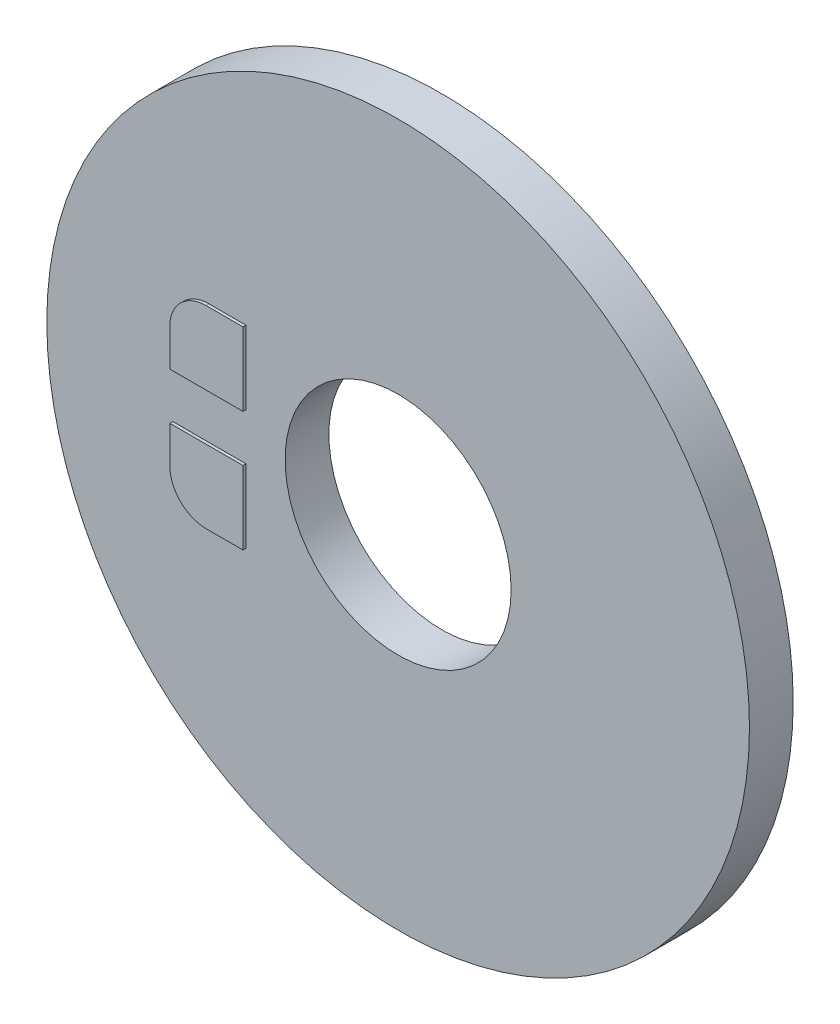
ISO-10303-21;
HEADER;
FILE_DESCRIPTION(('STEP AP214'),'2;1');
FILE_NAME('part.step','',(''),(''),'','','');
FILE_SCHEMA(('AUTOMOTIVE_DESIGN { 1 0 10303 214 1 1 1 1 }'));
ENDSEC;
DATA;
#1=APPLICATION_CONTEXT('core data for automotive mechanical design processes');
#2=APPLICATION_PROTOCOL_DEFINITION('international standard','automotive_design',2000,#1);
#3=PRODUCT_CONTEXT('',#1,'mechanical');
#4=PRODUCT('Part','Part','',(#3));
#5=PRODUCT_RELATED_PRODUCT_CATEGORY('part','',(#4));
#6=PRODUCT_DEFINITION_FORMATION('','',#4);
#7=PRODUCT_DEFINITION_CONTEXT('part definition',#1,'design');
#8=PRODUCT_DEFINITION('design','',#6,#7);
#9=PRODUCT_DEFINITION_SHAPE('','',#8);
#10=(LENGTH_UNIT() NAMED_UNIT(*) SI_UNIT(.MILLI.,.METRE.));
#11=(NAMED_UNIT(*) PLANE_ANGLE_UNIT() SI_UNIT($,.RADIAN.));
#12=(NAMED_UNIT(*) SI_UNIT($,.STERADIAN.) SOLID_ANGLE_UNIT());
#13=UNCERTAINTY_MEASURE_WITH_UNIT(LENGTH_MEASURE(1.E-05),#10,'distance_accuracy_value','');
#14=(GEOMETRIC_REPRESENTATION_CONTEXT(3) GLOBAL_UNCERTAINTY_ASSIGNED_CONTEXT((#13)) GLOBAL_UNIT_ASSIGNED_CONTEXT((#10,
#11,#12)) REPRESENTATION_CONTEXT('',''));
#15=CARTESIAN_POINT('',(0.,0.,0.));
#16=DIRECTION('',(0.,0.,1.));
#17=DIRECTION('',(1.,0.,0.));
#18=AXIS2_PLACEMENT_3D('',#15,#16,#17);
#19=CARTESIAN_POINT('',(0.,0.,1.89738));
#20=DIRECTION('',(0.,0.,1.));
#21=DIRECTION('',(1.,0.,0.));
#22=AXIS2_PLACEMENT_3D('',#19,#20,#21);
#23=PLANE('',#22);
#24=DIRECTION('',(0.,-1.,0.));
#25=VECTOR('',#24,1.);
#26=CARTESIAN_POINT('',(-6.604,-4.191,1.89738));
#27=LINE('',#26,#25);
#28=CARTESIAN_POINT('',(-6.604,-1.016,1.89738));
#29=VERTEX_POINT('',#28);
#30=CARTESIAN_POINT('',(-6.604,-4.191,1.89738));
#31=VERTEX_POINT('',#30);
#32=EDGE_CURVE('E117',#29,#31,#27,.T.);
#33=ORIENTED_EDGE('',*,*,#32,.T.);
#34=DIRECTION('',(-1.,0.,0.));
#35=VECTOR('',#34,1.);
#36=CARTESIAN_POINT('',(-8.2042,-4.191,1.89738));
#37=LINE('',#36,#35);
#38=CARTESIAN_POINT('',(-8.2042,-4.191,1.89738));
#39=VERTEX_POINT('',#38);
#40=EDGE_CURVE('E132',#31,#39,#37,.T.);
#41=ORIENTED_EDGE('',*,*,#40,.T.);
#42=CARTESIAN_POINT('',(-8.2042,-2.6162,1.89738));
#43=DIRECTION('',(0.,0.,-1.));
#44=DIRECTION('',(-1.,0.,0.));
#45=AXIS2_PLACEMENT_3D('',#42,#43,#44);
#46=CIRCLE('',#45,1.5748);
#47=CARTESIAN_POINT('',(-9.779,-2.6162,1.89738));
#48=VERTEX_POINT('',#47);
#49=EDGE_CURVE('E149',#39,#48,#46,.T.);
#50=ORIENTED_EDGE('',*,*,#49,.T.);
#51=DIRECTION('',(0.,1.,0.));
#52=VECTOR('',#51,1.);
#53=CARTESIAN_POINT('',(-9.779,-2.6162,1.89738));
#54=LINE('',#53,#52);
#55=CARTESIAN_POINT('',(-9.779,-1.016,1.89738));
#56=VERTEX_POINT('',#55);
#57=EDGE_CURVE('E55',#48,#56,#54,.T.);
#58=ORIENTED_EDGE('',*,*,#57,.T.);
#59=DIRECTION('',(1.,0.,0.));
#60=VECTOR('',#59,1.);
#61=CARTESIAN_POINT('',(-9.779,-1.016,1.89738));
#62=LINE('',#61,#60);
#63=EDGE_CURVE('E50',#56,#29,#62,.T.);
#64=ORIENTED_EDGE('',*,*,#63,.T.);
#65=EDGE_LOOP('',(#33,#41,#50,#58,#64));
#66=FACE_BOUND('',#65,.T.);
#67=DIRECTION('',(-1.,0.,0.));
#68=VECTOR('',#67,1.);
#69=CARTESIAN_POINT('',(-8.2042,4.191,1.89738));
#70=LINE('',#69,#68);
#71=CARTESIAN_POINT('',(-6.604,4.191,1.89738));
#72=VERTEX_POINT('',#71);
#73=CARTESIAN_POINT('',(-8.2042,4.191,1.89738));
#74=VERTEX_POINT('',#73);
#75=EDGE_CURVE('E175',#72,#74,#70,.T.);
#76=ORIENTED_EDGE('',*,*,#75,.F.);
#77=DIRECTION('',(0.,1.,0.));
#78=VECTOR('',#77,1.);
#79=CARTESIAN_POINT('',(-6.604,4.191,1.89738));
#80=LINE('',#79,#78);
#81=CARTESIAN_POINT('',(-6.604,1.016,1.89738));
#82=VERTEX_POINT('',#81);
#83=EDGE_CURVE('E120',#82,#72,#80,.T.);
#84=ORIENTED_EDGE('',*,*,#83,.F.);
#85=DIRECTION('',(1.,0.,0.));
#86=VECTOR('',#85,1.);
#87=CARTESIAN_POINT('',(-9.779,1.016,1.89738));
#88=LINE('',#87,#86);
#89=CARTESIAN_POINT('',(-9.779,1.016,1.89738));
#90=VERTEX_POINT('',#89);
#91=EDGE_CURVE('E164',#90,#82,#88,.T.);
#92=ORIENTED_EDGE('',*,*,#91,.F.);
#93=DIRECTION('',(0.,-1.,0.));
#94=VECTOR('',#93,1.);
#95=CARTESIAN_POINT('',(-9.779,2.6162,1.89738));
#96=LINE('',#95,#94);
#97=CARTESIAN_POINT('',(-9.779,2.6162,1.89738));
#98=VERTEX_POINT('',#97);
#99=EDGE_CURVE('E179',#98,#90,#96,.T.);
#100=ORIENTED_EDGE('',*,*,#99,.F.);
#101=CARTESIAN_POINT('',(-8.2042,2.6162,1.89738));
#102=DIRECTION('',(0.,0.,1.));
#103=DIRECTION('',(-1.,0.,0.));
#104=AXIS2_PLACEMENT_3D('',#101,#102,#103);
#105=CIRCLE('',#104,1.5748);
#106=EDGE_CURVE('E177',#74,#98,#105,.T.);
#107=ORIENTED_EDGE('',*,*,#106,.F.);
#108=EDGE_LOOP('',(#76,#84,#92,#100,#107));
#109=FACE_BOUND('',#108,.T.);
#110=CARTESIAN_POINT('',(0.,0.,1.89738));
#111=DIRECTION('',(0.,0.,1.));
#112=DIRECTION('',(1.,0.,0.));
#113=AXIS2_PLACEMENT_3D('',#110,#111,#112);
#114=CIRCLE('',#113,4.9022);
#115=CARTESIAN_POINT('',(4.9022,0.,1.89738));
#116=VERTEX_POINT('',#115);
#117=EDGE_CURVE('E146',#116,#116,#114,.T.);
#118=ORIENTED_EDGE('',*,*,#117,.F.);
#119=EDGE_LOOP('',(#118));
#120=FACE_BOUND('',#119,.T.);
#121=CARTESIAN_POINT('',(0.,0.,1.89738));
#122=DIRECTION('',(0.,0.,1.));
#123=DIRECTION('',(1.,0.,0.));
#124=AXIS2_PLACEMENT_3D('',#121,#122,#123);
#125=CIRCLE('',#124,15.24);
#126=CARTESIAN_POINT('',(-15.24,0.,1.89738));
#127=VERTEX_POINT('',#126);
#128=EDGE_CURVE('E12',#127,#127,#125,.T.);
#129=ORIENTED_EDGE('',*,*,#128,.T.);
#130=EDGE_LOOP('',(#129));
#131=FACE_BOUND('',#130,.T.);
#132=ADVANCED_FACE('F33',(#66,#109,#120,#131),#23,.T.);
#133=CARTESIAN_POINT('',(0.,0.,0.));
#134=DIRECTION('',(0.,0.,1.));
#135=DIRECTION('',(1.,0.,0.));
#136=AXIS2_PLACEMENT_3D('',#133,#134,#135);
#137=PLANE('',#136);
#138=CARTESIAN_POINT('',(0.,0.,0.));
#139=DIRECTION('',(0.,0.,1.));
#140=DIRECTION('',(1.,0.,0.));
#141=AXIS2_PLACEMENT_3D('',#138,#139,#140);
#142=CIRCLE('',#141,4.9022);
#143=CARTESIAN_POINT('',(4.9022,0.,0.));
#144=VERTEX_POINT('',#143);
#145=EDGE_CURVE('E37',#144,#144,#142,.T.);
#146=ORIENTED_EDGE('',*,*,#145,.T.);
#147=EDGE_LOOP('',(#146));
#148=FACE_BOUND('',#147,.T.);
#149=CARTESIAN_POINT('',(0.,0.,0.));
#150=DIRECTION('',(0.,0.,1.));
#151=DIRECTION('',(1.,0.,0.));
#152=AXIS2_PLACEMENT_3D('',#149,#150,#151);
#153=CIRCLE('',#152,15.24);
#154=CARTESIAN_POINT('',(-15.24,0.,0.));
#155=VERTEX_POINT('',#154);
#156=EDGE_CURVE('E42',#155,#155,#153,.T.);
#157=ORIENTED_EDGE('',*,*,#156,.F.);
#158=EDGE_LOOP('',(#157));
#159=FACE_BOUND('',#158,.T.);
#160=ADVANCED_FACE('F199',(#148,#159),#137,.F.);
#161=CARTESIAN_POINT('',(0.,0.,1.89738));
#162=DIRECTION('',(0.,0.,-1.));
#163=DIRECTION('',(-1.,0.,0.));
#164=AXIS2_PLACEMENT_3D('',#161,#162,#163);
#165=CYLINDRICAL_SURFACE('',#164,15.24);
#166=CARTESIAN_POINT('',(-15.24,0.,0.));
#167=CARTESIAN_POINT('',(-15.24,0.,0.0197643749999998));
#168=CARTESIAN_POINT('',(-15.24,0.,0.0395287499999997));
#169=CARTESIAN_POINT('',(-15.24,0.,0.0790574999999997));
#170=CARTESIAN_POINT('',(-15.24,0.,0.0988218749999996));
#171=CARTESIAN_POINT('',(-15.24,0.,0.138350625));
#172=CARTESIAN_POINT('',(-15.24,0.,0.158115));
#173=CARTESIAN_POINT('',(-15.24,0.,0.197643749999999));
#174=CARTESIAN_POINT('',(-15.24,0.,0.217408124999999));
#175=CARTESIAN_POINT('',(-15.24,0.,0.256936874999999));
#176=CARTESIAN_POINT('',(-15.24,0.,0.276701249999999));
#177=CARTESIAN_POINT('',(-15.24,0.,0.316229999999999));
#178=CARTESIAN_POINT('',(-15.24,0.,0.335994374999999));
#179=CARTESIAN_POINT('',(-15.24,0.,0.375523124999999));
#180=CARTESIAN_POINT('',(-15.24,0.,0.395287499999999));
#181=CARTESIAN_POINT('',(-15.24,0.,0.434816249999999));
#182=CARTESIAN_POINT('',(-15.24,0.,0.454580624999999));
#183=CARTESIAN_POINT('',(-15.24,0.,0.494109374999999));
#184=CARTESIAN_POINT('',(-15.24,0.,0.513873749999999));
#185=CARTESIAN_POINT('',(-15.24,0.,0.553402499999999));
#186=CARTESIAN_POINT('',(-15.24,0.,0.573166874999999));
#187=CARTESIAN_POINT('',(-15.24,0.,0.612695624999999));
#188=CARTESIAN_POINT('',(-15.24,0.,0.632459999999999));
#189=CARTESIAN_POINT('',(-15.24,0.,0.671988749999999));
#190=CARTESIAN_POINT('',(-15.24,0.,0.691753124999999));
#191=CARTESIAN_POINT('',(-15.24,0.,0.731281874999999));
#192=CARTESIAN_POINT('',(-15.24,0.,0.751046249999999));
#193=CARTESIAN_POINT('',(-15.24,0.,0.790574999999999));
#194=CARTESIAN_POINT('',(-15.24,0.,0.810339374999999));
#195=CARTESIAN_POINT('',(-15.24,0.,0.849868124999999));
#196=CARTESIAN_POINT('',(-15.24,0.,0.869632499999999));
#197=CARTESIAN_POINT('',(-15.24,0.,0.909161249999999));
#198=CARTESIAN_POINT('',(-15.24,0.,0.928925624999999));
#199=CARTESIAN_POINT('',(-15.24,0.,0.968454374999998));
#200=CARTESIAN_POINT('',(-15.24,0.,0.988218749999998));
#201=CARTESIAN_POINT('',(-15.24,0.,1.0277475));
#202=CARTESIAN_POINT('',(-15.24,0.,1.047511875));
#203=CARTESIAN_POINT('',(-15.24,0.,1.087040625));
#204=CARTESIAN_POINT('',(-15.24,0.,1.106805));
#205=CARTESIAN_POINT('',(-15.24,0.,1.14633375));
#206=CARTESIAN_POINT('',(-15.24,0.,1.166098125));
#207=CARTESIAN_POINT('',(-15.24,0.,1.205626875));
#208=CARTESIAN_POINT('',(-15.24,0.,1.22539125));
#209=CARTESIAN_POINT('',(-15.24,0.,1.26492));
#210=CARTESIAN_POINT('',(-15.24,0.,1.284684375));
#211=CARTESIAN_POINT('',(-15.24,0.,1.324213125));
#212=CARTESIAN_POINT('',(-15.24,0.,1.3439775));
#213=CARTESIAN_POINT('',(-15.24,0.,1.38350625));
#214=CARTESIAN_POINT('',(-15.24,0.,1.403270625));
#215=CARTESIAN_POINT('',(-15.24,0.,1.442799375));
#216=CARTESIAN_POINT('',(-15.24,0.,1.46256375));
#217=CARTESIAN_POINT('',(-15.24,0.,1.5020925));
#218=CARTESIAN_POINT('',(-15.24,0.,1.521856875));
#219=CARTESIAN_POINT('',(-15.24,0.,1.561385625));
#220=CARTESIAN_POINT('',(-15.24,0.,1.58115));
#221=CARTESIAN_POINT('',(-15.24,0.,1.62067875));
#222=CARTESIAN_POINT('',(-15.24,0.,1.640443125));
#223=CARTESIAN_POINT('',(-15.24,0.,1.679971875));
#224=CARTESIAN_POINT('',(-15.24,0.,1.69973625));
#225=CARTESIAN_POINT('',(-15.24,0.,1.739265));
#226=CARTESIAN_POINT('',(-15.24,0.,1.759029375));
#227=CARTESIAN_POINT('',(-15.24,0.,1.798558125));
#228=CARTESIAN_POINT('',(-15.24,0.,1.8183225));
#229=CARTESIAN_POINT('',(-15.24,0.,1.85785125));
#230=CARTESIAN_POINT('',(-15.24,0.,1.877615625));
#231=CARTESIAN_POINT('',(-15.24,0.,1.89738));
#232=B_SPLINE_CURVE_WITH_KNOTS('',3,(#166,#167,#168,#169,#170,#171,#172,#173,#174,#175,#176,
#177,#178,#179,#180,#181,#182,#183,#184,#185,#186,#187,#188,#189,#190,#191,#192,#193,#194,#195,
#196,#197,#198,#199,#200,#201,#202,#203,#204,#205,#206,#207,#208,#209,#210,#211,#212,#213,#214,
#215,#216,#217,#218,#219,#220,#221,#222,#223,#224,#225,#226,#227,#228,#229,#230,#231),
.UNSPECIFIED.,.F.,.F.,(4,2,2,2,2,2,2,2,2,2,2,2,2,2,2,2,2,2,2,2,2,2,2,2,2,2,2,2,2,2,2,2,4),(0.,
0.0592931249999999,0.11858625,0.177879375,0.2371725,0.296465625,0.355758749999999,0.415051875,
0.474344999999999,0.533638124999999,0.592931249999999,0.652224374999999,0.711517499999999,
0.770810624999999,0.830103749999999,0.889396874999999,0.948689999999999,1.007983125,1.06727625,
1.126569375,1.1858625,1.245155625,1.30444875,1.363741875,1.423035,1.482328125,1.54162125,
1.600914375,1.6602075,1.719500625,1.77879375,1.838086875,1.89738),.UNSPECIFIED.);
#233=EDGE_CURVE('BSEAM35',#155,#127,#232,.T.);
#234=ORIENTED_EDGE('',*,*,#156,.T.);
#235=ORIENTED_EDGE('',*,*,#128,.F.);
#236=ORIENTED_EDGE('',*,*,#233,.T.);
#237=ORIENTED_EDGE('',*,*,#233,.F.);
#238=EDGE_LOOP('',(#234,#236,#235,#237));
#239=FACE_BOUND('',#238,.T.);
#240=ADVANCED_FACE('F35',(#239),#165,.T.);
#241=CARTESIAN_POINT('',(-6.604,4.191,2.02438));
#242=DIRECTION('',(-1.,0.,0.));
#243=DIRECTION('',(0.,-1.,0.));
#244=AXIS2_PLACEMENT_3D('',#241,#242,#243);
#245=PLANE('',#244);
#246=ORIENTED_EDGE('',*,*,#83,.T.);
#247=DIRECTION('',(0.,0.,-1.));
#248=VECTOR('',#247,1.);
#249=CARTESIAN_POINT('',(-6.604,4.191,2.02438));
#250=LINE('',#249,#248);
#251=CARTESIAN_POINT('',(-6.604,4.191,2.02438));
#252=VERTEX_POINT('',#251);
#253=EDGE_CURVE('E193',#252,#72,#250,.T.);
#254=ORIENTED_EDGE('',*,*,#253,.F.);
#255=DIRECTION('',(0.,1.,0.));
#256=VECTOR('',#255,1.);
#257=CARTESIAN_POINT('',(-6.604,4.191,2.02438));
#258=LINE('',#257,#256);
#259=CARTESIAN_POINT('',(-6.604,1.016,2.02438));
#260=VERTEX_POINT('',#259);
#261=EDGE_CURVE('E160',#260,#252,#258,.T.);
#262=ORIENTED_EDGE('',*,*,#261,.F.);
#263=DIRECTION('',(0.,0.,-1.));
#264=VECTOR('',#263,1.);
#265=CARTESIAN_POINT('',(-6.604,1.016,2.02438));
#266=LINE('',#265,#264);
#267=EDGE_CURVE('E172',#260,#82,#266,.T.);
#268=ORIENTED_EDGE('',*,*,#267,.T.);
#269=EDGE_LOOP('',(#246,#254,#262,#268));
#270=FACE_BOUND('',#269,.T.);
#271=ADVANCED_FACE('F206',(#270),#245,.F.);
#272=CARTESIAN_POINT('',(-8.2042,4.191,2.02438));
#273=DIRECTION('',(0.,-1.,0.));
#274=DIRECTION('',(0.,0.,-1.));
#275=AXIS2_PLACEMENT_3D('',#272,#273,#274);
#276=PLANE('',#275);
#277=ORIENTED_EDGE('',*,*,#75,.T.);
#278=DIRECTION('',(0.,0.,-1.));
#279=VECTOR('',#278,1.);
#280=CARTESIAN_POINT('',(-8.2042,4.191,2.02438));
#281=LINE('',#280,#279);
#282=CARTESIAN_POINT('',(-8.2042,4.191,2.02438));
#283=VERTEX_POINT('',#282);
#284=EDGE_CURVE('E190',#283,#74,#281,.T.);
#285=ORIENTED_EDGE('',*,*,#284,.F.);
#286=DIRECTION('',(-1.,0.,0.));
#287=VECTOR('',#286,1.);
#288=CARTESIAN_POINT('',(-8.2042,4.191,2.02438));
#289=LINE('',#288,#287);
#290=EDGE_CURVE('E163',#252,#283,#289,.T.);
#291=ORIENTED_EDGE('',*,*,#290,.F.);
#292=ORIENTED_EDGE('',*,*,#253,.T.);
#293=EDGE_LOOP('',(#277,#285,#291,#292));
#294=FACE_BOUND('',#293,.T.);
#295=ADVANCED_FACE('F212',(#294),#276,.F.);
#296=CARTESIAN_POINT('',(-8.2042,2.6162,2.02438));
#297=DIRECTION('',(0.,0.,-1.));
#298=DIRECTION('',(-1.,0.,0.));
#299=AXIS2_PLACEMENT_3D('',#296,#297,#298);
#300=CYLINDRICAL_SURFACE('',#299,1.5748);
#301=ORIENTED_EDGE('',*,*,#106,.T.);
#302=DIRECTION('',(0.,0.,-1.));
#303=VECTOR('',#302,1.);
#304=CARTESIAN_POINT('',(-9.779,2.6162,2.02438));
#305=LINE('',#304,#303);
#306=CARTESIAN_POINT('',(-9.779,2.6162,2.02438));
#307=VERTEX_POINT('',#306);
#308=EDGE_CURVE('E187',#307,#98,#305,.T.);
#309=ORIENTED_EDGE('',*,*,#308,.F.);
#310=CARTESIAN_POINT('',(-8.2042,2.6162,2.02438));
#311=DIRECTION('',(0.,0.,1.));
#312=DIRECTION('',(-1.,0.,0.));
#313=AXIS2_PLACEMENT_3D('',#310,#311,#312);
#314=CIRCLE('',#313,1.5748);
#315=EDGE_CURVE('E166',#283,#307,#314,.T.);
#316=ORIENTED_EDGE('',*,*,#315,.F.);
#317=ORIENTED_EDGE('',*,*,#284,.T.);
#318=EDGE_LOOP('',(#301,#309,#316,#317));
#319=FACE_BOUND('',#318,.T.);
#320=ADVANCED_FACE('F216',(#319),#300,.T.);
#321=CARTESIAN_POINT('',(-9.779,2.6162,2.02438));
#322=DIRECTION('',(1.,0.,0.));
#323=DIRECTION('',(0.,1.,0.));
#324=AXIS2_PLACEMENT_3D('',#321,#322,#323);
#325=PLANE('',#324);
#326=ORIENTED_EDGE('',*,*,#99,.T.);
#327=DIRECTION('',(0.,0.,-1.));
#328=VECTOR('',#327,1.);
#329=CARTESIAN_POINT('',(-9.779,1.016,2.02438));
#330=LINE('',#329,#328);
#331=CARTESIAN_POINT('',(-9.779,1.016,2.02438));
#332=VERTEX_POINT('',#331);
#333=EDGE_CURVE('E185',#332,#90,#330,.T.);
#334=ORIENTED_EDGE('',*,*,#333,.F.);
#335=DIRECTION('',(0.,-1.,0.));
#336=VECTOR('',#335,1.);
#337=CARTESIAN_POINT('',(-9.779,2.6162,2.02438));
#338=LINE('',#337,#336);
#339=EDGE_CURVE('E168',#307,#332,#338,.T.);
#340=ORIENTED_EDGE('',*,*,#339,.F.);
#341=ORIENTED_EDGE('',*,*,#308,.T.);
#342=EDGE_LOOP('',(#326,#334,#340,#341));
#343=FACE_BOUND('',#342,.T.);
#344=ADVANCED_FACE('F220',(#343),#325,.F.);
#345=CARTESIAN_POINT('',(-9.779,1.016,2.02438));
#346=DIRECTION('',(0.,1.,0.));
#347=DIRECTION('',(0.,0.,1.));
#348=AXIS2_PLACEMENT_3D('',#345,#346,#347);
#349=PLANE('',#348);
#350=ORIENTED_EDGE('',*,*,#91,.T.);
#351=ORIENTED_EDGE('',*,*,#267,.F.);
#352=DIRECTION('',(1.,0.,0.));
#353=VECTOR('',#352,1.);
#354=CARTESIAN_POINT('',(-9.779,1.016,2.02438));
#355=LINE('',#354,#353);
#356=EDGE_CURVE('E170',#332,#260,#355,.T.);
#357=ORIENTED_EDGE('',*,*,#356,.F.);
#358=ORIENTED_EDGE('',*,*,#333,.T.);
#359=EDGE_LOOP('',(#350,#351,#357,#358));
#360=FACE_BOUND('',#359,.T.);
#361=ADVANCED_FACE('F224',(#360),#349,.F.);
#362=CARTESIAN_POINT('',(-8.2042,2.6162,2.02438));
#363=DIRECTION('',(0.,0.,-1.));
#364=DIRECTION('',(-1.,0.,0.));
#365=AXIS2_PLACEMENT_3D('',#362,#363,#364);
#366=PLANE('',#365);
#367=ORIENTED_EDGE('',*,*,#261,.T.);
#368=ORIENTED_EDGE('',*,*,#290,.T.);
#369=ORIENTED_EDGE('',*,*,#315,.T.);
#370=ORIENTED_EDGE('',*,*,#339,.T.);
#371=ORIENTED_EDGE('',*,*,#356,.T.);
#372=EDGE_LOOP('',(#367,#368,#369,#370,#371));
#373=FACE_BOUND('',#372,.T.);
#374=ADVANCED_FACE('F228',(#373),#366,.F.);
#375=CARTESIAN_POINT('',(-6.604,-4.191,2.02438));
#376=DIRECTION('',(1.,0.,0.));
#377=DIRECTION('',(0.,1.,0.));
#378=AXIS2_PLACEMENT_3D('',#375,#376,#377);
#379=PLANE('',#378);
#380=ORIENTED_EDGE('',*,*,#32,.F.);
#381=DIRECTION('',(0.,0.,-1.));
#382=VECTOR('',#381,1.);
#383=CARTESIAN_POINT('',(-6.604,-1.016,2.02438));
#384=LINE('',#383,#382);
#385=CARTESIAN_POINT('',(-6.604,-1.016,2.02438));
#386=VERTEX_POINT('',#385);
#387=EDGE_CURVE('E111',#386,#29,#384,.T.);
#388=ORIENTED_EDGE('',*,*,#387,.F.);
#389=DIRECTION('',(0.,-1.,0.));
#390=VECTOR('',#389,1.);
#391=CARTESIAN_POINT('',(-6.604,-4.191,2.02438));
#392=LINE('',#391,#390);
#393=CARTESIAN_POINT('',(-6.604,-4.191,2.02438));
#394=VERTEX_POINT('',#393);
#395=EDGE_CURVE('E115',#386,#394,#392,.T.);
#396=ORIENTED_EDGE('',*,*,#395,.T.);
#397=DIRECTION('',(0.,0.,-1.));
#398=VECTOR('',#397,1.);
#399=CARTESIAN_POINT('',(-6.604,-4.191,2.02438));
#400=LINE('',#399,#398);
#401=EDGE_CURVE('E144',#394,#31,#400,.T.);
#402=ORIENTED_EDGE('',*,*,#401,.T.);
#403=EDGE_LOOP('',(#380,#388,#396,#402));
#404=FACE_BOUND('',#403,.T.);
#405=ADVANCED_FACE('F113',(#404),#379,.T.);
#406=CARTESIAN_POINT('',(-9.779,-1.016,2.02438));
#407=DIRECTION('',(0.,1.,0.));
#408=DIRECTION('',(0.,0.,1.));
#409=AXIS2_PLACEMENT_3D('',#406,#407,#408);
#410=PLANE('',#409);
#411=ORIENTED_EDGE('',*,*,#63,.F.);
#412=DIRECTION('',(0.,0.,-1.));
#413=VECTOR('',#412,1.);
#414=CARTESIAN_POINT('',(-9.779,-1.016,2.02438));
#415=LINE('',#414,#413);
#416=CARTESIAN_POINT('',(-9.779,-1.016,2.02438));
#417=VERTEX_POINT('',#416);
#418=EDGE_CURVE('E121',#417,#56,#415,.T.);
#419=ORIENTED_EDGE('',*,*,#418,.F.);
#420=DIRECTION('',(1.,0.,0.));
#421=VECTOR('',#420,1.);
#422=CARTESIAN_POINT('',(-9.779,-1.016,2.02438));
#423=LINE('',#422,#421);
#424=EDGE_CURVE('E127',#417,#386,#423,.T.);
#425=ORIENTED_EDGE('',*,*,#424,.T.);
#426=ORIENTED_EDGE('',*,*,#387,.T.);
#427=EDGE_LOOP('',(#411,#419,#425,#426));
#428=FACE_BOUND('',#427,.T.);
#429=ADVANCED_FACE('F134',(#428),#410,.T.);
#430=CARTESIAN_POINT('',(-9.779,-2.6162,2.02438));
#431=DIRECTION('',(-1.,0.,0.));
#432=DIRECTION('',(0.,-1.,0.));
#433=AXIS2_PLACEMENT_3D('',#430,#431,#432);
#434=PLANE('',#433);
#435=ORIENTED_EDGE('',*,*,#57,.F.);
#436=DIRECTION('',(0.,0.,-1.));
#437=VECTOR('',#436,1.);
#438=CARTESIAN_POINT('',(-9.779,-2.6162,2.02438));
#439=LINE('',#438,#437);
#440=CARTESIAN_POINT('',(-9.779,-2.6162,2.02438));
#441=VERTEX_POINT('',#440);
#442=EDGE_CURVE('E156',#441,#48,#439,.T.);
#443=ORIENTED_EDGE('',*,*,#442,.F.);
#444=DIRECTION('',(0.,1.,0.));
#445=VECTOR('',#444,1.);
#446=CARTESIAN_POINT('',(-9.779,-2.6162,2.02438));
#447=LINE('',#446,#445);
#448=EDGE_CURVE('E135',#441,#417,#447,.T.);
#449=ORIENTED_EDGE('',*,*,#448,.T.);
#450=ORIENTED_EDGE('',*,*,#418,.T.);
#451=EDGE_LOOP('',(#435,#443,#449,#450));
#452=FACE_BOUND('',#451,.T.);
#453=ADVANCED_FACE('F237',(#452),#434,.T.);
#454=CARTESIAN_POINT('',(-8.2042,-2.6162,2.02438));
#455=DIRECTION('',(0.,0.,-1.));
#456=DIRECTION('',(-1.,0.,0.));
#457=AXIS2_PLACEMENT_3D('',#454,#455,#456);
#458=CYLINDRICAL_SURFACE('',#457,1.5748);
#459=ORIENTED_EDGE('',*,*,#49,.F.);
#460=DIRECTION('',(0.,0.,-1.));
#461=VECTOR('',#460,1.);
#462=CARTESIAN_POINT('',(-8.2042,-4.191,2.02438));
#463=LINE('',#462,#461);
#464=CARTESIAN_POINT('',(-8.2042,-4.191,2.02438));
#465=VERTEX_POINT('',#464);
#466=EDGE_CURVE('E153',#465,#39,#463,.T.);
#467=ORIENTED_EDGE('',*,*,#466,.F.);
#468=CARTESIAN_POINT('',(-8.2042,-2.6162,2.02438));
#469=DIRECTION('',(0.,0.,-1.));
#470=DIRECTION('',(-1.,0.,0.));
#471=AXIS2_PLACEMENT_3D('',#468,#469,#470);
#472=CIRCLE('',#471,1.5748);
#473=EDGE_CURVE('E137',#465,#441,#472,.T.);
#474=ORIENTED_EDGE('',*,*,#473,.T.);
#475=ORIENTED_EDGE('',*,*,#442,.T.);
#476=EDGE_LOOP('',(#459,#467,#474,#475));
#477=FACE_BOUND('',#476,.T.);
#478=ADVANCED_FACE('F240',(#477),#458,.T.);
#479=CARTESIAN_POINT('',(-8.2042,-4.191,2.02438));
#480=DIRECTION('',(0.,-1.,0.));
#481=DIRECTION('',(0.,0.,-1.));
#482=AXIS2_PLACEMENT_3D('',#479,#480,#481);
#483=PLANE('',#482);
#484=ORIENTED_EDGE('',*,*,#40,.F.);
#485=ORIENTED_EDGE('',*,*,#401,.F.);
#486=DIRECTION('',(-1.,0.,0.));
#487=VECTOR('',#486,1.);
#488=CARTESIAN_POINT('',(-8.2042,-4.191,2.02438));
#489=LINE('',#488,#487);
#490=EDGE_CURVE('E131',#394,#465,#489,.T.);
#491=ORIENTED_EDGE('',*,*,#490,.T.);
#492=ORIENTED_EDGE('',*,*,#466,.T.);
#493=EDGE_LOOP('',(#484,#485,#491,#492));
#494=FACE_BOUND('',#493,.T.);
#495=ADVANCED_FACE('F244',(#494),#483,.T.);
#496=CARTESIAN_POINT('',(-8.2042,-2.6162,2.02438));
#497=DIRECTION('',(0.,0.,-1.));
#498=DIRECTION('',(-1.,0.,0.));
#499=AXIS2_PLACEMENT_3D('',#496,#497,#498);
#500=PLANE('',#499);
#501=ORIENTED_EDGE('',*,*,#395,.F.);
#502=ORIENTED_EDGE('',*,*,#424,.F.);
#503=ORIENTED_EDGE('',*,*,#448,.F.);
#504=ORIENTED_EDGE('',*,*,#473,.F.);
#505=ORIENTED_EDGE('',*,*,#490,.F.);
#506=EDGE_LOOP('',(#501,#502,#503,#504,#505));
#507=FACE_BOUND('',#506,.T.);
#508=ADVANCED_FACE('F125',(#507),#500,.F.);
#509=CARTESIAN_POINT('',(0.,0.,-0.642620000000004));
#510=DIRECTION('',(0.,0.,1.));
#511=DIRECTION('',(1.,0.,0.));
#512=AXIS2_PLACEMENT_3D('',#509,#510,#511);
#513=CYLINDRICAL_SURFACE('',#512,4.9022);
#514=ORIENTED_EDGE('',*,*,#117,.T.);
#515=EDGE_LOOP('',(#514));
#516=FACE_BOUND('',#515,.T.);
#517=ORIENTED_EDGE('',*,*,#145,.F.);
#518=EDGE_LOOP('',(#517));
#519=FACE_BOUND('',#518,.T.);
#520=ADVANCED_FACE('F251',(#516,#519),#513,.F.);
#521=CLOSED_SHELL('',(#132,#160,#240,#271,#295,#320,#344,#361,#374,#405,#429,#453,#478,#495,
#508,#520));
#522=MANIFOLD_SOLID_BREP('B2',#521);
#523=ADVANCED_BREP_SHAPE_REPRESENTATION('',(#18,#522),#14);
#524=SHAPE_DEFINITION_REPRESENTATION(#9,#523);
ENDSEC;
END-ISO-10303-21;
